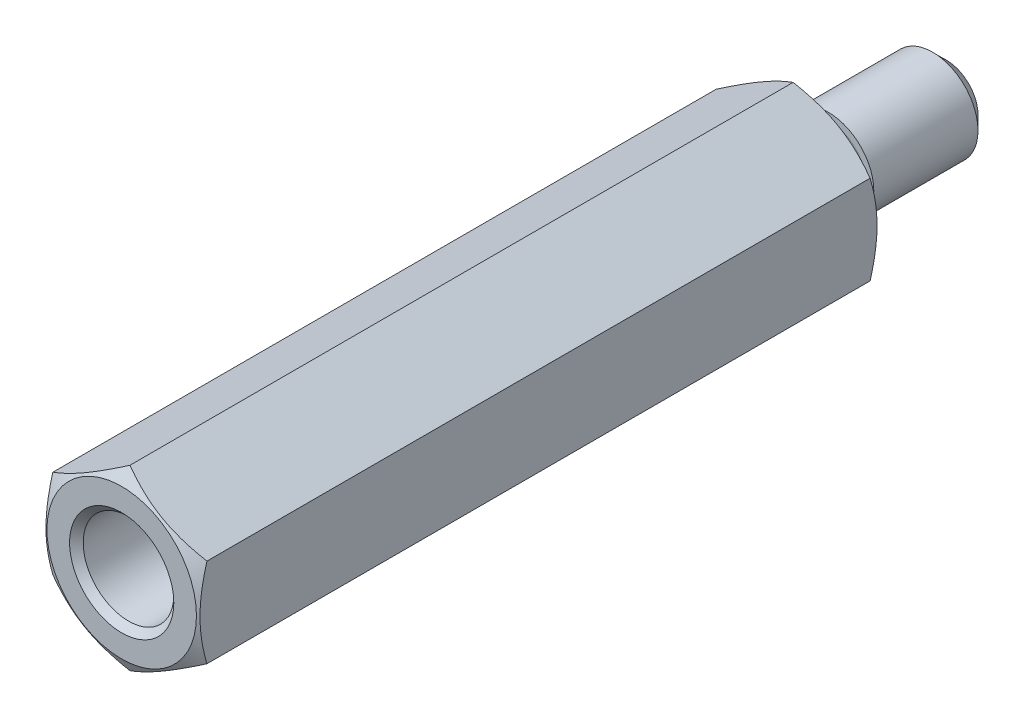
ISO-10303-21;
HEADER;
FILE_DESCRIPTION(('STEP AP214'),'2;1');
FILE_NAME('part.step','',(''),(''),'','','');
FILE_SCHEMA(('AUTOMOTIVE_DESIGN { 1 0 10303 214 1 1 1 1 }'));
ENDSEC;
DATA;
#1=APPLICATION_CONTEXT('core data for automotive mechanical design processes');
#2=APPLICATION_PROTOCOL_DEFINITION('international standard','automotive_design',2000,#1);
#3=PRODUCT_CONTEXT('',#1,'mechanical');
#4=PRODUCT('Part','Part','',(#3));
#5=PRODUCT_RELATED_PRODUCT_CATEGORY('part','',(#4));
#6=PRODUCT_DEFINITION_FORMATION('','',#4);
#7=PRODUCT_DEFINITION_CONTEXT('part definition',#1,'design');
#8=PRODUCT_DEFINITION('design','',#6,#7);
#9=PRODUCT_DEFINITION_SHAPE('','',#8);
#10=(LENGTH_UNIT() NAMED_UNIT(*) SI_UNIT(.MILLI.,.METRE.));
#11=(NAMED_UNIT(*) PLANE_ANGLE_UNIT() SI_UNIT($,.RADIAN.));
#12=(NAMED_UNIT(*) SI_UNIT($,.STERADIAN.) SOLID_ANGLE_UNIT());
#13=UNCERTAINTY_MEASURE_WITH_UNIT(LENGTH_MEASURE(1.E-05),#10,'distance_accuracy_value','');
#14=(GEOMETRIC_REPRESENTATION_CONTEXT(3) GLOBAL_UNCERTAINTY_ASSIGNED_CONTEXT((#13)) GLOBAL_UNIT_ASSIGNED_CONTEXT((#10,
#11,#12)) REPRESENTATION_CONTEXT('',''));
#15=CARTESIAN_POINT('',(0.,0.,0.));
#16=DIRECTION('',(0.,0.,1.));
#17=DIRECTION('',(1.,0.,0.));
#18=AXIS2_PLACEMENT_3D('',#15,#16,#17);
#19=CARTESIAN_POINT('',(8.5,4.90747728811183,0.));
#20=DIRECTION('',(0.,0.,-1.));
#21=DIRECTION('',(-1.,0.,0.));
#22=AXIS2_PLACEMENT_3D('',#19,#20,#21);
#23=PLANE('',#22);
#24=CARTESIAN_POINT('',(0.,0.,0.));
#25=DIRECTION('',(0.,0.,-1.));
#26=DIRECTION('',(-1.,0.,0.));
#27=AXIS2_PLACEMENT_3D('',#24,#25,#26);
#28=CIRCLE('',#27,4.25);
#29=CARTESIAN_POINT('',(-4.25,0.,0.));
#30=VERTEX_POINT('',#29);
#31=EDGE_CURVE('E9',#30,#30,#28,.F.);
#32=ORIENTED_EDGE('',*,*,#31,.T.);
#33=EDGE_LOOP('',(#32));
#34=FACE_BOUND('',#33,.T.);
#35=CARTESIAN_POINT('',(0.,0.,0.));
#36=DIRECTION('',(0.,0.,1.));
#37=DIRECTION('',(1.,0.,0.));
#38=AXIS2_PLACEMENT_3D('',#35,#36,#37);
#39=CIRCLE('',#38,8.25);
#40=CARTESIAN_POINT('',(8.25,0.,0.));
#41=VERTEX_POINT('',#40);
#42=EDGE_CURVE('E136',#41,#41,#39,.T.);
#43=ORIENTED_EDGE('',*,*,#42,.F.);
#44=EDGE_LOOP('',(#43));
#45=FACE_BOUND('',#44,.T.);
#46=ADVANCED_FACE('F14',(#34,#45),#23,.T.);
#47=CARTESIAN_POINT('',(0.,0.,42.756485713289));
#48=DIRECTION('',(0.,0.,1.));
#49=DIRECTION('',(1.,0.,0.));
#50=AXIS2_PLACEMENT_3D('',#47,#48,#49);
#51=CYLINDRICAL_SURFACE('',#50,3.85);
#52=CARTESIAN_POINT('',(0.,0.,-2.6));
#53=DIRECTION('',(0.,0.,-1.));
#54=DIRECTION('',(-1.,0.,0.));
#55=AXIS2_PLACEMENT_3D('',#52,#53,#54);
#56=CIRCLE('',#55,3.85);
#57=CARTESIAN_POINT('',(-3.85,0.,-2.6));
#58=VERTEX_POINT('',#57);
#59=EDGE_CURVE('E103',#58,#58,#56,.F.);
#60=ORIENTED_EDGE('',*,*,#59,.T.);
#61=EDGE_LOOP('',(#60));
#62=FACE_BOUND('',#61,.T.);
#63=CARTESIAN_POINT('',(0.,0.,-0.4));
#64=DIRECTION('',(0.,0.,-1.));
#65=DIRECTION('',(-1.,0.,0.));
#66=AXIS2_PLACEMENT_3D('',#63,#64,#65);
#67=CIRCLE('',#66,3.85);
#68=CARTESIAN_POINT('',(-3.85,0.,-0.4));
#69=VERTEX_POINT('',#68);
#70=EDGE_CURVE('E100',#69,#69,#67,.T.);
#71=ORIENTED_EDGE('',*,*,#70,.T.);
#72=EDGE_LOOP('',(#71));
#73=FACE_BOUND('',#72,.T.);
#74=ADVANCED_FACE('F120',(#62,#73),#51,.T.);
#75=CARTESIAN_POINT('',(0.,3.85,-3.));
#76=DIRECTION('',(0.,0.,-1.));
#77=DIRECTION('',(-1.,0.,0.));
#78=AXIS2_PLACEMENT_3D('',#75,#76,#77);
#79=PLANE('',#78);
#80=CARTESIAN_POINT('',(0.,0.,-3.));
#81=DIRECTION('',(0.,0.,-1.));
#82=DIRECTION('',(-1.,0.,0.));
#83=AXIS2_PLACEMENT_3D('',#80,#81,#82);
#84=CIRCLE('',#83,4.25);
#85=CARTESIAN_POINT('',(-4.25,0.,-3.));
#86=VERTEX_POINT('',#85);
#87=EDGE_CURVE('E24',#86,#86,#84,.T.);
#88=ORIENTED_EDGE('',*,*,#87,.T.);
#89=EDGE_LOOP('',(#88));
#90=FACE_BOUND('',#89,.T.);
#91=CARTESIAN_POINT('',(0.,0.,-3.));
#92=DIRECTION('',(0.,0.,1.));
#93=DIRECTION('',(1.,0.,0.));
#94=AXIS2_PLACEMENT_3D('',#91,#92,#93);
#95=CIRCLE('',#94,5.);
#96=CARTESIAN_POINT('',(5.,0.,-3.));
#97=VERTEX_POINT('',#96);
#98=EDGE_CURVE('E269',#97,#97,#95,.T.);
#99=ORIENTED_EDGE('',*,*,#98,.T.);
#100=EDGE_LOOP('',(#99));
#101=FACE_BOUND('',#100,.T.);
#102=ADVANCED_FACE('F109',(#90,#101),#79,.F.);
#103=CARTESIAN_POINT('',(0.,0.,42.756485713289));
#104=DIRECTION('',(0.,0.,1.));
#105=DIRECTION('',(1.,0.,0.));
#106=AXIS2_PLACEMENT_3D('',#103,#104,#105);
#107=CYLINDRICAL_SURFACE('',#106,5.);
#108=CARTESIAN_POINT('',(0.,0.,-14.5));
#109=DIRECTION('',(0.,0.,1.));
#110=DIRECTION('',(1.,0.,0.));
#111=AXIS2_PLACEMENT_3D('',#108,#109,#110);
#112=CIRCLE('',#111,5.);
#113=CARTESIAN_POINT('',(5.,0.,-14.5));
#114=VERTEX_POINT('',#113);
#115=EDGE_CURVE('E88',#114,#114,#112,.T.);
#116=ORIENTED_EDGE('',*,*,#115,.T.);
#117=EDGE_LOOP('',(#116));
#118=FACE_BOUND('',#117,.T.);
#119=ORIENTED_EDGE('',*,*,#98,.F.);
#120=EDGE_LOOP('',(#119));
#121=FACE_BOUND('',#120,.T.);
#122=ADVANCED_FACE('F392',(#118,#121),#107,.T.);
#123=CARTESIAN_POINT('',(0.,5.,-16.));
#124=DIRECTION('',(0.,0.,1.));
#125=DIRECTION('',(1.,0.,0.));
#126=AXIS2_PLACEMENT_3D('',#123,#124,#125);
#127=PLANE('',#126);
#128=CARTESIAN_POINT('',(0.,0.,-16.));
#129=DIRECTION('',(0.,0.,1.));
#130=DIRECTION('',(1.,0.,0.));
#131=AXIS2_PLACEMENT_3D('',#128,#129,#130);
#132=CIRCLE('',#131,3.5);
#133=CARTESIAN_POINT('',(3.5,0.,-16.));
#134=VERTEX_POINT('',#133);
#135=EDGE_CURVE('E92',#134,#134,#132,.F.);
#136=ORIENTED_EDGE('',*,*,#135,.T.);
#137=EDGE_LOOP('',(#136));
#138=FACE_BOUND('',#137,.T.);
#139=ADVANCED_FACE('F382',(#138),#127,.F.);
#140=CARTESIAN_POINT('',(0.,0.,-14.5));
#141=DIRECTION('',(0.,0.,1.));
#142=DIRECTION('',(1.,0.,0.));
#143=AXIS2_PLACEMENT_3D('',#140,#141,#142);
#144=CONICAL_SURFACE('',#143,5.,0.785398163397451);
#145=ORIENTED_EDGE('',*,*,#135,.F.);
#146=EDGE_LOOP('',(#145));
#147=FACE_BOUND('',#146,.T.);
#148=ORIENTED_EDGE('',*,*,#115,.F.);
#149=EDGE_LOOP('',(#148));
#150=FACE_BOUND('',#149,.T.);
#151=ADVANCED_FACE('F116',(#147,#150),#144,.T.);
#152=CARTESIAN_POINT('',(0.,0.,-2.6));
#153=DIRECTION('',(0.,0.,-1.));
#154=DIRECTION('',(-1.,0.,0.));
#155=AXIS2_PLACEMENT_3D('',#152,#153,#154);
#156=TOROIDAL_SURFACE('',#155,4.25,0.4);
#157=ORIENTED_EDGE('',*,*,#87,.F.);
#158=EDGE_LOOP('',(#157));
#159=FACE_BOUND('',#158,.T.);
#160=ORIENTED_EDGE('',*,*,#59,.F.);
#161=EDGE_LOOP('',(#160));
#162=FACE_BOUND('',#161,.T.);
#163=ADVANCED_FACE('F112',(#159,#162),#156,.F.);
#164=CARTESIAN_POINT('',(0.,0.,-0.4));
#165=DIRECTION('',(0.,0.,-1.));
#166=DIRECTION('',(-1.,0.,0.));
#167=AXIS2_PLACEMENT_3D('',#164,#165,#166);
#168=TOROIDAL_SURFACE('',#167,4.25,0.4);
#169=ORIENTED_EDGE('',*,*,#70,.F.);
#170=EDGE_LOOP('',(#169));
#171=FACE_BOUND('',#170,.T.);
#172=ORIENTED_EDGE('',*,*,#31,.F.);
#173=EDGE_LOOP('',(#172));
#174=FACE_BOUND('',#173,.T.);
#175=ADVANCED_FACE('F115',(#171,#174),#168,.F.);
#176=CARTESIAN_POINT('',(0.,0.,0.903526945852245));
#177=DIRECTION('',(0.,0.,1.));
#178=DIRECTION('',(1.,0.,0.));
#179=AXIS2_PLACEMENT_3D('',#176,#177,#178);
#180=CONICAL_SURFACE('',#179,9.81495457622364,1.0471975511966);
#181=ORIENTED_EDGE('',*,*,#42,.T.);
#182=EDGE_LOOP('',(#181));
#183=FACE_BOUND('',#182,.T.);
#184=CARTESIAN_POINT('',(-0.000199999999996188,9.81507004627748,0.903593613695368));
#185=CARTESIAN_POINT('',(0.186639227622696,9.70719836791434,0.841323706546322));
#186=CARTESIAN_POINT('',(0.374175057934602,9.59892450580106,0.781879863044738));
#187=CARTESIAN_POINT('',(0.750769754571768,9.38149745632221,0.669422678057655));
#188=CARTESIAN_POINT('',(0.939829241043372,9.27234391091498,0.616412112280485));
#189=CARTESIAN_POINT('',(1.5100347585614,8.94313560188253,0.468070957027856));
#190=CARTESIAN_POINT('',(1.89343164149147,8.72178130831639,0.383696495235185));
#191=CARTESIAN_POINT('',(2.46717766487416,8.39052888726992,0.284757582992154));
#192=CARTESIAN_POINT('',(2.65581276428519,8.28162036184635,0.256572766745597));
#193=CARTESIAN_POINT('',(3.03393602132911,8.06331079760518,0.209311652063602));
#194=CARTESIAN_POINT('',(3.22342410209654,7.95390980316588,0.190234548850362));
#195=CARTESIAN_POINT('',(3.6027265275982,7.73491944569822,0.161672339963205));
#196=CARTESIAN_POINT('',(3.7925402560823,7.62533043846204,0.152176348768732));
#197=CARTESIAN_POINT('',(4.17234305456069,7.40605119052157,0.142979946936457));
#198=CARTESIAN_POINT('',(4.36233211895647,7.29636095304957,0.143279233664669));
#199=CARTESIAN_POINT('',(4.71752301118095,7.09129139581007,0.152992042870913));
#200=CARTESIAN_POINT('',(4.8827499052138,6.99589760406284,0.161220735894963));
#201=CARTESIAN_POINT('',(5.21281671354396,6.80533344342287,0.184926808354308));
#202=CARTESIAN_POINT('',(5.37765660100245,6.71016309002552,0.200404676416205));
#203=CARTESIAN_POINT('',(5.87153810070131,6.4250204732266,0.257346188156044));
#204=CARTESIAN_POINT('',(6.19970550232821,6.23555293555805,0.309310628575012));
#205=CARTESIAN_POINT('',(6.85952142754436,5.85460803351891,0.439222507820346));
#206=CARTESIAN_POINT('',(7.19108574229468,5.66317928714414,0.51772063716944));
#207=CARTESIAN_POINT('',(7.84926989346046,5.28317649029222,0.695878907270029));
#208=CARTESIAN_POINT('',(8.17589815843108,5.0945975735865,0.795497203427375));
#209=CARTESIAN_POINT('',(8.5002,4.90736181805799,0.903593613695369));
#210=B_SPLINE_CURVE_WITH_KNOTS('',3,(#184,#185,#186,#187,#188,#189,#190,#191,#192,#193,#194,
#195,#196,#197,#198,#199,#200,#201,#202,#203,#204,#205,#206,#207,#208,#209),.UNSPECIFIED.,.F.,
.F.,(4,2,2,2,2,2,2,2,2,2,2,2,4),(0.,0.673596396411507,1.34748239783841,2.69805431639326,
3.356799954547,4.01548737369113,4.67342558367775,5.33134346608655,5.90409556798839,
6.47688628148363,7.62328361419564,8.79510569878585,9.96462743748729),.UNSPECIFIED.);
#211=CARTESIAN_POINT('',(0.,9.81495457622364,0.903526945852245));
#212=VERTEX_POINT('',#211);
#213=CARTESIAN_POINT('',(8.5,4.90747728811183,0.903526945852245));
#214=VERTEX_POINT('',#213);
#215=EDGE_CURVE('E31',#212,#214,#210,.T.);
#216=ORIENTED_EDGE('',*,*,#215,.T.);
#217=CARTESIAN_POINT('',(8.5,-12.9953438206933,4.20214445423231));
#218=CARTESIAN_POINT('',(8.5,-12.6223011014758,4.02195280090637));
#219=CARTESIAN_POINT('',(8.5,-12.2483741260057,3.84355854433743));
#220=CARTESIAN_POINT('',(8.5,-11.4982734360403,3.49139239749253));
#221=CARTESIAN_POINT('',(8.5,-11.1220993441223,3.31762131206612));
#222=CARTESIAN_POINT('',(8.5,-10.3649842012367,2.97480925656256));
#223=CARTESIAN_POINT('',(8.5,-9.98402817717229,2.80580123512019));
#224=CARTESIAN_POINT('',(8.5,-9.21897765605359,2.47507337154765));
#225=CARTESIAN_POINT('',(8.5,-8.83488332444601,2.31335314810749));
#226=CARTESIAN_POINT('',(8.5,-8.05827000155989,1.99725792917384));
#227=CARTESIAN_POINT('',(8.5,-7.66570525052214,1.84299473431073));
#228=CARTESIAN_POINT('',(8.5,-6.87593938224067,1.54660014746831));
#229=CARTESIAN_POINT('',(8.5,-6.47873775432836,1.40447010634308));
#230=CARTESIAN_POINT('',(8.5,-5.67988381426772,1.13617601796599));
#231=CARTESIAN_POINT('',(8.5,-5.27824308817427,1.00997785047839));
#232=CARTESIAN_POINT('',(8.5,-4.46926711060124,0.777656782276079));
#233=CARTESIAN_POINT('',(8.5,-4.06193370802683,0.671527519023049));
#234=CARTESIAN_POINT('',(8.5,-3.24121808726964,0.484515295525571));
#235=CARTESIAN_POINT('',(8.5,-2.82783404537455,0.403640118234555));
#236=CARTESIAN_POINT('',(8.5,-2.20413783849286,0.305328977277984));
#237=CARTESIAN_POINT('',(8.5,-1.99561028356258,0.276390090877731));
#238=CARTESIAN_POINT('',(8.5,-1.57758365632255,0.226749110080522));
#239=CARTESIAN_POINT('',(8.5,-1.36808467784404,0.206046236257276));
#240=CARTESIAN_POINT('',(8.5,-0.94971684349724,0.173433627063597));
#241=CARTESIAN_POINT('',(8.5,-0.740852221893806,0.161469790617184));
#242=CARTESIAN_POINT('',(8.5,-0.322804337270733,0.146398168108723));
#243=CARTESIAN_POINT('',(8.5,-0.11362107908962,0.143290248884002));
#244=CARTESIAN_POINT('',(8.5,0.3046299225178,0.14600440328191));
#245=CARTESIAN_POINT('',(8.5,0.513697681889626,0.151823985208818));
#246=CARTESIAN_POINT('',(8.5,0.93140649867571,0.172248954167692));
#247=CARTESIAN_POINT('',(8.5,1.14004753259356,0.186854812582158));
#248=CARTESIAN_POINT('',(8.5,1.64621912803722,0.232643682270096));
#249=CARTESIAN_POINT('',(8.5,1.94335676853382,0.268255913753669));
#250=CARTESIAN_POINT('',(8.5,2.53529083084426,0.355313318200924));
#251=CARTESIAN_POINT('',(8.5,2.83008689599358,0.406760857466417));
#252=CARTESIAN_POINT('',(8.5,3.71148367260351,0.582274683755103));
#253=CARTESIAN_POINT('',(8.5,4.29393978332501,0.727394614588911));
#254=CARTESIAN_POINT('',(8.5,5.16515755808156,0.977457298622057));
#255=CARTESIAN_POINT('',(8.5,5.45847541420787,1.06742556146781));
#256=CARTESIAN_POINT('',(8.5,6.04227759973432,1.25629246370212));
#257=CARTESIAN_POINT('',(8.5,6.33276167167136,1.35519190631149));
#258=CARTESIAN_POINT('',(8.5,6.90944623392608,1.55980497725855));
#259=CARTESIAN_POINT('',(8.5,7.19566165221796,1.66547695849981));
#260=CARTESIAN_POINT('',(8.5,7.76565926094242,1.88291533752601));
#261=CARTESIAN_POINT('',(8.5,8.04944225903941,1.99467961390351));
#262=CARTESIAN_POINT('',(8.5,8.33220149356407,2.10891920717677));
#263=B_SPLINE_CURVE_WITH_KNOTS('',3,(#217,#218,#219,#220,#221,#222,#223,#224,#225,#226,#227,
#228,#229,#230,#231,#232,#233,#234,#235,#236,#237,#238,#239,#240,#241,#242,#243,#244,#245,#246,
#247,#248,#249,#250,#251,#252,#253,#254,#255,#256,#257,#258,#259,#260,#261,#262),.UNSPECIFIED.,
.F.,.F.,(4,2,2,2,2,2,2,2,2,2,2,2,2,2,2,2,2,2,2,2,2,2,4),(0.,1.24286396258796,2.48594289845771,
3.73617049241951,4.98633259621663,6.25153784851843,7.51688378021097,8.77947209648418,
10.0416594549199,11.3042354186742,11.93567629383,12.5670573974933,13.1944958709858,
13.8219249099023,14.4491788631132,15.0764664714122,15.9737486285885,16.8711649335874,
18.6694595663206,19.5898052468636,20.5102337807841,21.4254630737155,22.3403756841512),.UNSPECIFIED.);
#264=CARTESIAN_POINT('',(8.5,-4.90747728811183,0.903526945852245));
#265=VERTEX_POINT('',#264);
#266=EDGE_CURVE('E138',#214,#265,#263,.F.);
#267=ORIENTED_EDGE('',*,*,#266,.T.);
#268=CARTESIAN_POINT('',(8.5002,-4.90736181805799,0.903593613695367));
#269=CARTESIAN_POINT('',(8.31336077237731,-5.01523349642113,0.841323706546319));
#270=CARTESIAN_POINT('',(8.1258249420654,-5.12350735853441,0.781879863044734));
#271=CARTESIAN_POINT('',(7.74923024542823,-5.34093440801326,0.66942267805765));
#272=CARTESIAN_POINT('',(7.56017075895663,-5.45008795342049,0.61641211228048));
#273=CARTESIAN_POINT('',(6.9899652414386,-5.77929626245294,0.468070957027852));
#274=CARTESIAN_POINT('',(6.60656835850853,-6.00065055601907,0.383696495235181));
#275=CARTESIAN_POINT('',(6.03282233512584,-6.33190297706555,0.28475758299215));
#276=CARTESIAN_POINT('',(5.84418723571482,-6.44081150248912,0.256572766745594));
#277=CARTESIAN_POINT('',(5.46606397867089,-6.65912106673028,0.209311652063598));
#278=CARTESIAN_POINT('',(5.27657589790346,-6.76852206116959,0.190234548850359));
#279=CARTESIAN_POINT('',(4.8972734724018,-6.98751241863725,0.161672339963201));
#280=CARTESIAN_POINT('',(4.70745974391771,-7.09710142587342,0.152176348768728));
#281=CARTESIAN_POINT('',(4.32765694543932,-7.3163806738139,0.142979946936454));
#282=CARTESIAN_POINT('',(4.13766788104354,-7.42607091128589,0.143279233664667));
#283=CARTESIAN_POINT('',(3.78247698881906,-7.63114046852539,0.152992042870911));
#284=CARTESIAN_POINT('',(3.6172500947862,-7.72653426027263,0.161220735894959));
#285=CARTESIAN_POINT('',(3.28718328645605,-7.9170984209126,0.184926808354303));
#286=CARTESIAN_POINT('',(3.12234339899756,-8.01226877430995,0.2004046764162));
#287=CARTESIAN_POINT('',(2.62846189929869,-8.29741139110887,0.25734618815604));
#288=CARTESIAN_POINT('',(2.30029449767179,-8.48687892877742,0.309310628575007));
#289=CARTESIAN_POINT('',(1.64047857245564,-8.86782383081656,0.439222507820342));
#290=CARTESIAN_POINT('',(1.30891425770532,-9.05925257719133,0.517720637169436));
#291=CARTESIAN_POINT('',(0.650730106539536,-9.43925537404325,0.695878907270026));
#292=CARTESIAN_POINT('',(0.324101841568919,-9.62783429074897,0.795497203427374));
#293=CARTESIAN_POINT('',(-0.000200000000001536,-9.81507004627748,0.903593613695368));
#294=B_SPLINE_CURVE_WITH_KNOTS('',3,(#268,#269,#270,#271,#272,#273,#274,#275,#276,#277,#278,
#279,#280,#281,#282,#283,#284,#285,#286,#287,#288,#289,#290,#291,#292,#293),.UNSPECIFIED.,.F.,
.F.,(4,2,2,2,2,2,2,2,2,2,2,2,4),(0.,0.673596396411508,1.34748239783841,2.69805431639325,
3.35679995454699,4.01548737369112,4.67342558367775,5.33134346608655,5.90409556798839,
6.47688628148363,7.62328361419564,8.79510569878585,9.9646274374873),.UNSPECIFIED.);
#295=CARTESIAN_POINT('',(0.,-9.81495457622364,0.903526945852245));
#296=VERTEX_POINT('',#295);
#297=EDGE_CURVE('E140',#265,#296,#294,.T.);
#298=ORIENTED_EDGE('',*,*,#297,.T.);
#299=CARTESIAN_POINT('',(0.000199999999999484,-9.81507004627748,0.903593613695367));
#300=CARTESIAN_POINT('',(-0.186639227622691,-9.70719836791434,0.84132370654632));
#301=CARTESIAN_POINT('',(-0.374175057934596,-9.59892450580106,0.781879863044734));
#302=CARTESIAN_POINT('',(-0.750769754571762,-9.3814974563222,0.66942267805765));
#303=CARTESIAN_POINT('',(-0.939829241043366,-9.27234391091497,0.616412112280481));
#304=CARTESIAN_POINT('',(-1.5100347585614,-8.94313560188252,0.468070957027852));
#305=CARTESIAN_POINT('',(-1.89343164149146,-8.72178130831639,0.383696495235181));
#306=CARTESIAN_POINT('',(-2.46717766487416,-8.39052888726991,0.284757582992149));
#307=CARTESIAN_POINT('',(-2.65581276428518,-8.28162036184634,0.256572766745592));
#308=CARTESIAN_POINT('',(-3.03393602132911,-8.06331079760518,0.209311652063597));
#309=CARTESIAN_POINT('',(-3.22342410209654,-7.95390980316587,0.190234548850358));
#310=CARTESIAN_POINT('',(-3.6027265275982,-7.73491944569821,0.1616723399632));
#311=CARTESIAN_POINT('',(-3.79254025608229,-7.62533043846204,0.152176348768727));
#312=CARTESIAN_POINT('',(-4.17234305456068,-7.40605119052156,0.142979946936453));
#313=CARTESIAN_POINT('',(-4.36233211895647,-7.29636095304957,0.143279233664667));
#314=CARTESIAN_POINT('',(-4.71752301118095,-7.09129139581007,0.152992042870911));
#315=CARTESIAN_POINT('',(-4.8827499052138,-6.99589760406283,0.161220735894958));
#316=CARTESIAN_POINT('',(-5.21281671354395,-6.80533344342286,0.184926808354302));
#317=CARTESIAN_POINT('',(-5.37765660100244,-6.71016309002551,0.2004046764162));
#318=CARTESIAN_POINT('',(-5.87153810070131,-6.42502047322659,0.257346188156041));
#319=CARTESIAN_POINT('',(-6.19970550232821,-6.23555293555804,0.309310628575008));
#320=CARTESIAN_POINT('',(-6.85952142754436,-5.8546080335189,0.439222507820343));
#321=CARTESIAN_POINT('',(-7.19108574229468,-5.66317928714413,0.517720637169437));
#322=CARTESIAN_POINT('',(-7.84926989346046,-5.28317649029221,0.695878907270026));
#323=CARTESIAN_POINT('',(-8.17589815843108,-5.09459757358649,0.795497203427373));
#324=CARTESIAN_POINT('',(-8.5002,-4.90736181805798,0.903593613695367));
#325=B_SPLINE_CURVE_WITH_KNOTS('',3,(#299,#300,#301,#302,#303,#304,#305,#306,#307,#308,#309,
#310,#311,#312,#313,#314,#315,#316,#317,#318,#319,#320,#321,#322,#323,#324),.UNSPECIFIED.,.F.,
.F.,(4,2,2,2,2,2,2,2,2,2,2,2,4),(0.,0.673596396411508,1.34748239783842,2.69805431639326,
3.356799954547,4.01548737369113,4.67342558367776,5.33134346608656,5.9040955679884,
6.47688628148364,7.62328361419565,8.79510569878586,9.9646274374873),.UNSPECIFIED.);
#326=CARTESIAN_POINT('',(-8.5,-4.90747728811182,0.903526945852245));
#327=VERTEX_POINT('',#326);
#328=EDGE_CURVE('E237',#296,#327,#325,.T.);
#329=ORIENTED_EDGE('',*,*,#328,.T.);
#330=CARTESIAN_POINT('',(-8.5,-12.9953438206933,4.20214445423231));
#331=CARTESIAN_POINT('',(-8.5,-12.6223011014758,4.02195280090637));
#332=CARTESIAN_POINT('',(-8.5,-12.2483741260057,3.84355854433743));
#333=CARTESIAN_POINT('',(-8.5,-11.4982734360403,3.49139239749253));
#334=CARTESIAN_POINT('',(-8.5,-11.1220993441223,3.31762131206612));
#335=CARTESIAN_POINT('',(-8.5,-10.3649842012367,2.97480925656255));
#336=CARTESIAN_POINT('',(-8.5,-9.98402817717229,2.80580123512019));
#337=CARTESIAN_POINT('',(-8.5,-9.21897765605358,2.47507337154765));
#338=CARTESIAN_POINT('',(-8.5,-8.834883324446,2.31335314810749));
#339=CARTESIAN_POINT('',(-8.5,-8.05827000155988,1.99725792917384));
#340=CARTESIAN_POINT('',(-8.5,-7.66570525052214,1.84299473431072));
#341=CARTESIAN_POINT('',(-8.5,-6.87593938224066,1.54660014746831));
#342=CARTESIAN_POINT('',(-8.5,-6.47873775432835,1.40447010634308));
#343=CARTESIAN_POINT('',(-8.5,-5.67988381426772,1.13617601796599));
#344=CARTESIAN_POINT('',(-8.5,-5.27824308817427,1.00997785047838));
#345=CARTESIAN_POINT('',(-8.5,-4.46926711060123,0.777656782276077));
#346=CARTESIAN_POINT('',(-8.5,-4.06193370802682,0.671527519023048));
#347=CARTESIAN_POINT('',(-8.5,-3.24121808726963,0.48451529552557));
#348=CARTESIAN_POINT('',(-8.5,-2.82783404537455,0.403640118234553));
#349=CARTESIAN_POINT('',(-8.5,-2.20413783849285,0.305328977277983));
#350=CARTESIAN_POINT('',(-8.5,-1.99561028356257,0.27639009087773));
#351=CARTESIAN_POINT('',(-8.5,-1.57758365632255,0.226749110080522));
#352=CARTESIAN_POINT('',(-8.5,-1.36808467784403,0.206046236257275));
#353=CARTESIAN_POINT('',(-8.5,-0.949716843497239,0.173433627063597));
#354=CARTESIAN_POINT('',(-8.5,-0.740852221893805,0.161469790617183));
#355=CARTESIAN_POINT('',(-8.5,-0.322804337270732,0.146398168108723));
#356=CARTESIAN_POINT('',(-8.5,-0.113621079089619,0.143290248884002));
#357=CARTESIAN_POINT('',(-8.5,0.304629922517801,0.146004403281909));
#358=CARTESIAN_POINT('',(-8.5,0.513697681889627,0.151823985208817));
#359=CARTESIAN_POINT('',(-8.5,0.931406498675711,0.172248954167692));
#360=CARTESIAN_POINT('',(-8.5,1.14004753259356,0.186854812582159));
#361=CARTESIAN_POINT('',(-8.5,1.64621912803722,0.232643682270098));
#362=CARTESIAN_POINT('',(-8.5,1.94335676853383,0.268255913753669));
#363=CARTESIAN_POINT('',(-8.5,2.53529083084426,0.355313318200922));
#364=CARTESIAN_POINT('',(-8.5,2.83008689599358,0.406760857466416));
#365=CARTESIAN_POINT('',(-8.5,3.71148367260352,0.582274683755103));
#366=CARTESIAN_POINT('',(-8.5,4.29393978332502,0.727394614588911));
#367=CARTESIAN_POINT('',(-8.5,5.16515755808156,0.977457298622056));
#368=CARTESIAN_POINT('',(-8.5,5.45847541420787,1.06742556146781));
#369=CARTESIAN_POINT('',(-8.5,6.04227759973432,1.25629246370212));
#370=CARTESIAN_POINT('',(-8.5,6.33276167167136,1.35519190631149));
#371=CARTESIAN_POINT('',(-8.5,6.90944623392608,1.55980497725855));
#372=CARTESIAN_POINT('',(-8.5,7.19566165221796,1.66547695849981));
#373=CARTESIAN_POINT('',(-8.5,7.76565926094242,1.88291533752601));
#374=CARTESIAN_POINT('',(-8.5,8.04944225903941,1.99467961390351));
#375=CARTESIAN_POINT('',(-8.5,8.33220149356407,2.10891920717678));
#376=B_SPLINE_CURVE_WITH_KNOTS('',3,(#330,#331,#332,#333,#334,#335,#336,#337,#338,#339,#340,
#341,#342,#343,#344,#345,#346,#347,#348,#349,#350,#351,#352,#353,#354,#355,#356,#357,#358,#359,
#360,#361,#362,#363,#364,#365,#366,#367,#368,#369,#370,#371,#372,#373,#374,#375),.UNSPECIFIED.,
.F.,.F.,(4,2,2,2,2,2,2,2,2,2,2,2,2,2,2,2,2,2,2,2,2,2,4),(0.,1.24286396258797,2.48594289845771,
3.73617049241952,4.98633259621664,6.25153784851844,7.51688378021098,8.77947209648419,
10.0416594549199,11.3042354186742,11.93567629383,12.5670573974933,13.1944958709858,
13.8219249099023,14.4491788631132,15.0764664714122,15.9737486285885,16.8711649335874,
18.6694595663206,19.5898052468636,20.5102337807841,21.4254630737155,22.3403756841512),.UNSPECIFIED.);
#377=CARTESIAN_POINT('',(-8.5,4.90747728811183,0.903526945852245));
#378=VERTEX_POINT('',#377);
#379=EDGE_CURVE('E70',#327,#378,#376,.T.);
#380=ORIENTED_EDGE('',*,*,#379,.T.);
#381=CARTESIAN_POINT('',(-8.5002,4.90736181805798,0.903593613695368));
#382=CARTESIAN_POINT('',(-8.31336077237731,5.01523349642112,0.84132370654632));
#383=CARTESIAN_POINT('',(-8.1258249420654,5.1235073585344,0.781879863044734));
#384=CARTESIAN_POINT('',(-7.74923024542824,5.34093440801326,0.66942267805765));
#385=CARTESIAN_POINT('',(-7.56017075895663,5.45008795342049,0.616412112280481));
#386=CARTESIAN_POINT('',(-6.9899652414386,5.77929626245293,0.468070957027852));
#387=CARTESIAN_POINT('',(-6.60656835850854,6.00065055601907,0.38369649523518));
#388=CARTESIAN_POINT('',(-6.03282233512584,6.33190297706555,0.28475758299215));
#389=CARTESIAN_POINT('',(-5.84418723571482,6.44081150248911,0.256572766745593));
#390=CARTESIAN_POINT('',(-5.46606397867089,6.65912106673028,0.209311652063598));
#391=CARTESIAN_POINT('',(-5.27657589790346,6.76852206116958,0.190234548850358));
#392=CARTESIAN_POINT('',(-4.8972734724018,6.98751241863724,0.161672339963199));
#393=CARTESIAN_POINT('',(-4.70745974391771,7.09710142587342,0.152176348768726));
#394=CARTESIAN_POINT('',(-4.32765694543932,7.3163806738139,0.142979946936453));
#395=CARTESIAN_POINT('',(-4.13766788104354,7.42607091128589,0.143279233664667));
#396=CARTESIAN_POINT('',(-3.78247698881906,7.63114046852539,0.152992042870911));
#397=CARTESIAN_POINT('',(-3.6172500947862,7.72653426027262,0.161220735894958));
#398=CARTESIAN_POINT('',(-3.28718328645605,7.9170984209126,0.184926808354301));
#399=CARTESIAN_POINT('',(-3.12234339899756,8.01226877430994,0.200404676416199));
#400=CARTESIAN_POINT('',(-2.62846189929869,8.29741139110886,0.25734618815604));
#401=CARTESIAN_POINT('',(-2.30029449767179,8.48687892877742,0.309310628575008));
#402=CARTESIAN_POINT('',(-1.64047857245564,8.86782383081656,0.439222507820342));
#403=CARTESIAN_POINT('',(-1.30891425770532,9.05925257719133,0.517720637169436));
#404=CARTESIAN_POINT('',(-0.650730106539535,9.43925537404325,0.695878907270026));
#405=CARTESIAN_POINT('',(-0.324101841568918,9.62783429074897,0.795497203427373));
#406=CARTESIAN_POINT('',(0.000200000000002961,9.81507004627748,0.903593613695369));
#407=B_SPLINE_CURVE_WITH_KNOTS('',3,(#381,#382,#383,#384,#385,#386,#387,#388,#389,#390,#391,
#392,#393,#394,#395,#396,#397,#398,#399,#400,#401,#402,#403,#404,#405,#406),.UNSPECIFIED.,.F.,
.F.,(4,2,2,2,2,2,2,2,2,2,2,2,4),(0.,0.673596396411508,1.34748239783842,2.69805431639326,
3.356799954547,4.01548737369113,4.67342558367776,5.33134346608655,5.90409556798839,
6.47688628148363,7.62328361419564,8.79510569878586,9.96462743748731),.UNSPECIFIED.);
#408=EDGE_CURVE('E67',#378,#212,#407,.T.);
#409=ORIENTED_EDGE('',*,*,#408,.T.);
#410=EDGE_LOOP('',(#216,#267,#298,#329,#380,#409));
#411=FACE_BOUND('',#410,.T.);
#412=ADVANCED_FACE('F68',(#183,#411),#180,.T.);
#413=CARTESIAN_POINT('',(0.,0.,75.));
#414=DIRECTION('',(0.,0.,1.));
#415=DIRECTION('',(1.,0.,0.));
#416=AXIS2_PLACEMENT_3D('',#413,#414,#415);
#417=CONICAL_SURFACE('',#416,5.75,0.785398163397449);
#418=CARTESIAN_POINT('',(0.,0.,74.25));
#419=DIRECTION('',(0.,0.,1.));
#420=DIRECTION('',(1.,0.,0.));
#421=AXIS2_PLACEMENT_3D('',#418,#419,#420);
#422=CIRCLE('',#421,5.);
#423=CARTESIAN_POINT('',(5.,0.,74.25));
#424=VERTEX_POINT('',#423);
#425=EDGE_CURVE('E19',#424,#424,#422,.F.);
#426=ORIENTED_EDGE('',*,*,#425,.T.);
#427=EDGE_LOOP('',(#426));
#428=FACE_BOUND('',#427,.T.);
#429=CARTESIAN_POINT('',(0.,0.,75.));
#430=DIRECTION('',(0.,0.,1.));
#431=DIRECTION('',(1.,0.,0.));
#432=AXIS2_PLACEMENT_3D('',#429,#430,#431);
#433=CIRCLE('',#432,5.75);
#434=CARTESIAN_POINT('',(5.75,0.,75.));
#435=VERTEX_POINT('',#434);
#436=EDGE_CURVE('E271',#435,#435,#433,.T.);
#437=ORIENTED_EDGE('',*,*,#436,.T.);
#438=EDGE_LOOP('',(#437));
#439=FACE_BOUND('',#438,.T.);
#440=ADVANCED_FACE('F189',(#428,#439),#417,.F.);
#441=CARTESIAN_POINT('',(8.5,4.90747728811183,75.));
#442=DIRECTION('',(0.,0.,-1.));
#443=DIRECTION('',(-1.,0.,0.));
#444=AXIS2_PLACEMENT_3D('',#441,#442,#443);
#445=PLANE('',#444);
#446=ORIENTED_EDGE('',*,*,#436,.F.);
#447=EDGE_LOOP('',(#446));
#448=FACE_BOUND('',#447,.T.);
#449=CARTESIAN_POINT('',(0.,0.,75.));
#450=DIRECTION('',(0.,0.,1.));
#451=DIRECTION('',(1.,0.,0.));
#452=AXIS2_PLACEMENT_3D('',#449,#450,#451);
#453=CIRCLE('',#452,8.25);
#454=CARTESIAN_POINT('',(8.25,0.,75.));
#455=VERTEX_POINT('',#454);
#456=EDGE_CURVE('E83',#455,#455,#453,.T.);
#457=ORIENTED_EDGE('',*,*,#456,.T.);
#458=EDGE_LOOP('',(#457));
#459=FACE_BOUND('',#458,.T.);
#460=ADVANCED_FACE('F168',(#448,#459),#445,.F.);
#461=CARTESIAN_POINT('',(0.,0.,75.));
#462=DIRECTION('',(0.,0.,-1.));
#463=DIRECTION('',(-1.,0.,0.));
#464=AXIS2_PLACEMENT_3D('',#461,#462,#463);
#465=CONICAL_SURFACE('',#464,8.25,1.0471975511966);
#466=ORIENTED_EDGE('',*,*,#456,.F.);
#467=EDGE_LOOP('',(#466));
#468=FACE_BOUND('',#467,.T.);
#469=CARTESIAN_POINT('',(8.5002,4.90736181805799,74.0964063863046));
#470=CARTESIAN_POINT('',(8.31336077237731,5.01523349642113,74.1586762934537));
#471=CARTESIAN_POINT('',(8.1258249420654,5.12350735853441,74.2181201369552));
#472=CARTESIAN_POINT('',(7.74923024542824,5.34093440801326,74.3305773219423));
#473=CARTESIAN_POINT('',(7.56017075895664,5.4500879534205,74.3835878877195));
#474=CARTESIAN_POINT('',(6.9899652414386,5.77929626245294,74.5319290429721));
#475=CARTESIAN_POINT('',(6.60656835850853,6.00065055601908,74.6163035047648));
#476=CARTESIAN_POINT('',(6.03282233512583,6.33190297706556,74.7152424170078));
#477=CARTESIAN_POINT('',(5.84418723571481,6.44081150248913,74.7434272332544));
#478=CARTESIAN_POINT('',(5.46606397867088,6.6591210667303,74.7906883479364));
#479=CARTESIAN_POINT('',(5.27657589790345,6.7685220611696,74.8097654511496));
#480=CARTESIAN_POINT('',(4.89727347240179,6.98751241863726,74.8383276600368));
#481=CARTESIAN_POINT('',(4.7074597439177,7.09710142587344,74.8478236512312));
#482=CARTESIAN_POINT('',(4.32765694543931,7.31638067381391,74.8570200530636));
#483=CARTESIAN_POINT('',(4.13766788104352,7.4260709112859,74.8567207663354));
#484=CARTESIAN_POINT('',(3.78247698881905,7.6311404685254,74.8470079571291));
#485=CARTESIAN_POINT('',(3.6172500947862,7.72653426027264,74.838779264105));
#486=CARTESIAN_POINT('',(3.28718328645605,7.91709842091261,74.8150731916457));
#487=CARTESIAN_POINT('',(3.12234339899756,8.01226877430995,74.7995953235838));
#488=CARTESIAN_POINT('',(2.62846189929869,8.29741139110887,74.742653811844));
#489=CARTESIAN_POINT('',(2.30029449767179,8.48687892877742,74.690689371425));
#490=CARTESIAN_POINT('',(1.64047857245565,8.86782383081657,74.5607774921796));
#491=CARTESIAN_POINT('',(1.30891425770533,9.05925257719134,74.4822793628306));
#492=CARTESIAN_POINT('',(0.650730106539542,9.43925537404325,74.30412109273));
#493=CARTESIAN_POINT('',(0.324101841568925,9.62783429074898,74.2045027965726));
#494=CARTESIAN_POINT('',(-0.000199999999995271,9.81507004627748,74.0964063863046));
#495=B_SPLINE_CURVE_WITH_KNOTS('',3,(#469,#470,#471,#472,#473,#474,#475,#476,#477,#478,#479,
#480,#481,#482,#483,#484,#485,#486,#487,#488,#489,#490,#491,#492,#493,#494),.UNSPECIFIED.,.F.,
.F.,(4,2,2,2,2,2,2,2,2,2,2,2,4),(0.,0.673596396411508,1.34748239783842,2.69805431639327,
3.35679995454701,4.01548737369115,4.67342558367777,5.33134346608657,5.9040955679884,
6.47688628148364,7.62328361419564,8.79510569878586,9.9646274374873),.UNSPECIFIED.);
#496=CARTESIAN_POINT('',(8.5,4.90747728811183,74.0964730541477));
#497=VERTEX_POINT('',#496);
#498=CARTESIAN_POINT('',(0.,9.81495457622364,74.0964730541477));
#499=VERTEX_POINT('',#498);
#500=EDGE_CURVE('E213',#497,#499,#495,.T.);
#501=ORIENTED_EDGE('',*,*,#500,.T.);
#502=CARTESIAN_POINT('',(0.000200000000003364,9.81507004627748,74.0964063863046));
#503=CARTESIAN_POINT('',(-0.186639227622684,9.70719836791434,74.1586762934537));
#504=CARTESIAN_POINT('',(-0.374175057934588,9.59892450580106,74.2181201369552));
#505=CARTESIAN_POINT('',(-0.750769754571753,9.38149745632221,74.3305773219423));
#506=CARTESIAN_POINT('',(-0.939829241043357,9.27234391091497,74.3835878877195));
#507=CARTESIAN_POINT('',(-1.51003475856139,8.94313560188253,74.5319290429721));
#508=CARTESIAN_POINT('',(-1.89343164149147,8.72178130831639,74.6163035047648));
#509=CARTESIAN_POINT('',(-2.46717766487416,8.39052888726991,74.7152424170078));
#510=CARTESIAN_POINT('',(-2.65581276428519,8.28162036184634,74.7434272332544));
#511=CARTESIAN_POINT('',(-3.03393602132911,8.06331079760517,74.7906883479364));
#512=CARTESIAN_POINT('',(-3.22342410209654,7.95390980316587,74.8097654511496));
#513=CARTESIAN_POINT('',(-3.6027265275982,7.73491944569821,74.8383276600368));
#514=CARTESIAN_POINT('',(-3.79254025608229,7.62533043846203,74.8478236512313));
#515=CARTESIAN_POINT('',(-4.17234305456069,7.40605119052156,74.8570200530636));
#516=CARTESIAN_POINT('',(-4.36233211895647,7.29636095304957,74.8567207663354));
#517=CARTESIAN_POINT('',(-4.71752301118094,7.09129139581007,74.8470079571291));
#518=CARTESIAN_POINT('',(-4.8827499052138,6.99589760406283,74.838779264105));
#519=CARTESIAN_POINT('',(-5.21281671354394,6.80533344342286,74.8150731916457));
#520=CARTESIAN_POINT('',(-5.37765660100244,6.71016309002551,74.7995953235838));
#521=CARTESIAN_POINT('',(-5.87153810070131,6.4250204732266,74.742653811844));
#522=CARTESIAN_POINT('',(-6.19970550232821,6.23555293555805,74.690689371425));
#523=CARTESIAN_POINT('',(-6.85952142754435,5.8546080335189,74.5607774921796));
#524=CARTESIAN_POINT('',(-7.19108574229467,5.66317928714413,74.4822793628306));
#525=CARTESIAN_POINT('',(-7.84926989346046,5.28317649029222,74.30412109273));
#526=CARTESIAN_POINT('',(-8.17589815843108,5.09459757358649,74.2045027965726));
#527=CARTESIAN_POINT('',(-8.5002,4.90736181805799,74.0964063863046));
#528=B_SPLINE_CURVE_WITH_KNOTS('',3,(#502,#503,#504,#505,#506,#507,#508,#509,#510,#511,#512,
#513,#514,#515,#516,#517,#518,#519,#520,#521,#522,#523,#524,#525,#526,#527),.UNSPECIFIED.,.F.,
.F.,(4,2,2,2,2,2,2,2,2,2,2,2,4),(0.,0.673596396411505,1.34748239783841,2.69805431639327,
3.35679995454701,4.01548737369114,4.67342558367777,5.33134346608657,5.9040955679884,
6.47688628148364,7.62328361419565,8.79510569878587,9.96462743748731),.UNSPECIFIED.);
#529=CARTESIAN_POINT('',(-8.5,4.90747728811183,74.0964730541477));
#530=VERTEX_POINT('',#529);
#531=EDGE_CURVE('E87',#499,#530,#528,.T.);
#532=ORIENTED_EDGE('',*,*,#531,.T.);
#533=CARTESIAN_POINT('',(-8.5,-12.9953438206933,70.7978555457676));
#534=CARTESIAN_POINT('',(-8.5,-12.6223011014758,70.9780471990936));
#535=CARTESIAN_POINT('',(-8.5,-12.2483741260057,71.1564414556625));
#536=CARTESIAN_POINT('',(-8.5,-11.4982734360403,71.5086076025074));
#537=CARTESIAN_POINT('',(-8.5,-11.1220993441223,71.6823786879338));
#538=CARTESIAN_POINT('',(-8.5,-10.3649842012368,72.0251907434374));
#539=CARTESIAN_POINT('',(-8.5,-9.98402817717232,72.1941987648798));
#540=CARTESIAN_POINT('',(-8.5,-9.21897765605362,72.5249266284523));
#541=CARTESIAN_POINT('',(-8.5,-8.83488332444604,72.6866468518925));
#542=CARTESIAN_POINT('',(-8.5,-8.05827000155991,73.0027420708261));
#543=CARTESIAN_POINT('',(-8.5,-7.66570525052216,73.1570052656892));
#544=CARTESIAN_POINT('',(-8.5,-6.87593938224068,73.4533998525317));
#545=CARTESIAN_POINT('',(-8.5,-6.47873775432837,73.5955298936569));
#546=CARTESIAN_POINT('',(-8.5,-5.67988381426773,73.863823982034));
#547=CARTESIAN_POINT('',(-8.5,-5.27824308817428,73.9900221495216));
#548=CARTESIAN_POINT('',(-8.5,-4.46926711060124,74.2223432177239));
#549=CARTESIAN_POINT('',(-8.5,-4.06193370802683,74.3284724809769));
#550=CARTESIAN_POINT('',(-8.5,-3.24121808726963,74.5154847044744));
#551=CARTESIAN_POINT('',(-8.5,-2.82783404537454,74.5963598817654));
#552=CARTESIAN_POINT('',(-8.5,-2.20413783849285,74.694671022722));
#553=CARTESIAN_POINT('',(-8.5,-1.99561028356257,74.7236099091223));
#554=CARTESIAN_POINT('',(-8.5,-1.57758365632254,74.7732508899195));
#555=CARTESIAN_POINT('',(-8.5,-1.36808467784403,74.7939537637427));
#556=CARTESIAN_POINT('',(-8.5,-0.949716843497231,74.8265663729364));
#557=CARTESIAN_POINT('',(-8.5,-0.740852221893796,74.8385302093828));
#558=CARTESIAN_POINT('',(-8.5,-0.322804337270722,74.8536018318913));
#559=CARTESIAN_POINT('',(-8.5,-0.113621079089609,74.856709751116));
#560=CARTESIAN_POINT('',(-8.5,0.304629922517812,74.8539955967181));
#561=CARTESIAN_POINT('',(-8.5,0.513697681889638,74.8481760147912));
#562=CARTESIAN_POINT('',(-8.5,0.931406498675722,74.8277510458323));
#563=CARTESIAN_POINT('',(-8.5,1.14004753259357,74.8131451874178));
#564=CARTESIAN_POINT('',(-8.5,1.64621912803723,74.7673563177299));
#565=CARTESIAN_POINT('',(-8.5,1.94335676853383,74.7317440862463));
#566=CARTESIAN_POINT('',(-8.5,2.53529083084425,74.6446866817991));
#567=CARTESIAN_POINT('',(-8.5,2.83008689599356,74.5932391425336));
#568=CARTESIAN_POINT('',(-8.5,3.71148367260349,74.4177253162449));
#569=CARTESIAN_POINT('',(-8.5,4.29393978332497,74.2726053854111));
#570=CARTESIAN_POINT('',(-8.5,5.16515755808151,74.0225427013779));
#571=CARTESIAN_POINT('',(-8.5,5.45847541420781,73.9325744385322));
#572=CARTESIAN_POINT('',(-8.5,6.04227759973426,73.7437075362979));
#573=CARTESIAN_POINT('',(-8.5,6.3327616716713,73.6448080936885));
#574=CARTESIAN_POINT('',(-8.5,6.90944623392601,73.4401950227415));
#575=CARTESIAN_POINT('',(-8.5,7.19566165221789,73.3345230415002));
#576=CARTESIAN_POINT('',(-8.5,7.76565926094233,73.117084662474));
#577=CARTESIAN_POINT('',(-8.5,8.04944225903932,73.0053203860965));
#578=CARTESIAN_POINT('',(-8.5,8.33220149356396,72.8910807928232));
#579=B_SPLINE_CURVE_WITH_KNOTS('',3,(#533,#534,#535,#536,#537,#538,#539,#540,#541,#542,#543,
#544,#545,#546,#547,#548,#549,#550,#551,#552,#553,#554,#555,#556,#557,#558,#559,#560,#561,#562,
#563,#564,#565,#566,#567,#568,#569,#570,#571,#572,#573,#574,#575,#576,#577,#578),.UNSPECIFIED.,
.F.,.F.,(4,2,2,2,2,2,2,2,2,2,2,2,2,2,2,2,2,2,2,2,2,2,4),(0.,1.24286396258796,2.4859428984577,
3.73617049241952,4.98633259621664,6.25153784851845,7.516883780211,8.77947209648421,
10.0416594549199,11.3042354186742,11.9356762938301,12.5670573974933,13.1944958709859,
13.8219249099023,14.4491788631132,15.0764664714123,15.9737486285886,16.8711649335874,
18.6694595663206,19.5898052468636,20.5102337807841,21.4254630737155,22.3403756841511),.UNSPECIFIED.);
#580=CARTESIAN_POINT('',(-8.5,-4.90747728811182,74.0964730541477));
#581=VERTEX_POINT('',#580);
#582=EDGE_CURVE('E202',#530,#581,#579,.F.);
#583=ORIENTED_EDGE('',*,*,#582,.T.);
#584=CARTESIAN_POINT('',(-8.5002,-4.90736181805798,74.0964063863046));
#585=CARTESIAN_POINT('',(-8.31336077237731,-5.01523349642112,74.1586762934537));
#586=CARTESIAN_POINT('',(-8.1258249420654,-5.1235073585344,74.2181201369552));
#587=CARTESIAN_POINT('',(-7.74923024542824,-5.34093440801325,74.3305773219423));
#588=CARTESIAN_POINT('',(-7.56017075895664,-5.45008795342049,74.3835878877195));
#589=CARTESIAN_POINT('',(-6.9899652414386,-5.77929626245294,74.5319290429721));
#590=CARTESIAN_POINT('',(-6.60656835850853,-6.00065055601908,74.6163035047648));
#591=CARTESIAN_POINT('',(-6.03282233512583,-6.33190297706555,74.7152424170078));
#592=CARTESIAN_POINT('',(-5.84418723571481,-6.44081150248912,74.7434272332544));
#593=CARTESIAN_POINT('',(-5.46606397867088,-6.65912106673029,74.7906883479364));
#594=CARTESIAN_POINT('',(-5.27657589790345,-6.76852206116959,74.8097654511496));
#595=CARTESIAN_POINT('',(-4.89727347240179,-6.98751241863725,74.8383276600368));
#596=CARTESIAN_POINT('',(-4.7074597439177,-7.09710142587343,74.8478236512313));
#597=CARTESIAN_POINT('',(-4.32765694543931,-7.3163806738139,74.8570200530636));
#598=CARTESIAN_POINT('',(-4.13766788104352,-7.42607091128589,74.8567207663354));
#599=CARTESIAN_POINT('',(-3.78247698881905,-7.63114046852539,74.8470079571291));
#600=CARTESIAN_POINT('',(-3.6172500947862,-7.72653426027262,74.838779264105));
#601=CARTESIAN_POINT('',(-3.28718328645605,-7.9170984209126,74.8150731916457));
#602=CARTESIAN_POINT('',(-3.12234339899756,-8.01226877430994,74.7995953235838));
#603=CARTESIAN_POINT('',(-2.62846189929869,-8.29741139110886,74.742653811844));
#604=CARTESIAN_POINT('',(-2.30029449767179,-8.48687892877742,74.690689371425));
#605=CARTESIAN_POINT('',(-1.64047857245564,-8.86782383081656,74.5607774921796));
#606=CARTESIAN_POINT('',(-1.30891425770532,-9.05925257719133,74.4822793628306));
#607=CARTESIAN_POINT('',(-0.650730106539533,-9.43925537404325,74.30412109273));
#608=CARTESIAN_POINT('',(-0.324101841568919,-9.62783429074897,74.2045027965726));
#609=CARTESIAN_POINT('',(0.000199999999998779,-9.81507004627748,74.0964063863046));
#610=B_SPLINE_CURVE_WITH_KNOTS('',3,(#584,#585,#586,#587,#588,#589,#590,#591,#592,#593,#594,
#595,#596,#597,#598,#599,#600,#601,#602,#603,#604,#605,#606,#607,#608,#609),.UNSPECIFIED.,.F.,
.F.,(4,2,2,2,2,2,2,2,2,2,2,2,4),(0.,0.673596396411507,1.34748239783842,2.69805431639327,
3.35679995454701,4.01548737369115,4.67342558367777,5.33134346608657,5.9040955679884,
6.47688628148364,7.62328361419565,8.79510569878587,9.96462743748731),.UNSPECIFIED.);
#611=CARTESIAN_POINT('',(0.,-9.81495457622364,74.0964730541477));
#612=VERTEX_POINT('',#611);
#613=EDGE_CURVE('E196',#581,#612,#610,.T.);
#614=ORIENTED_EDGE('',*,*,#613,.T.);
#615=CARTESIAN_POINT('',(-0.000200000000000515,-9.81507004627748,74.0964063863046));
#616=CARTESIAN_POINT('',(0.186639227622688,-9.70719836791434,74.1586762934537));
#617=CARTESIAN_POINT('',(0.374175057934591,-9.59892450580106,74.2181201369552));
#618=CARTESIAN_POINT('',(0.750769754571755,-9.38149745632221,74.3305773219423));
#619=CARTESIAN_POINT('',(0.939829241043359,-9.27234391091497,74.3835878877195));
#620=CARTESIAN_POINT('',(1.51003475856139,-8.94313560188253,74.5319290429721));
#621=CARTESIAN_POINT('',(1.89343164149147,-8.72178130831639,74.6163035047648));
#622=CARTESIAN_POINT('',(2.46717766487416,-8.39052888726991,74.7152424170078));
#623=CARTESIAN_POINT('',(2.65581276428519,-8.28162036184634,74.7434272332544));
#624=CARTESIAN_POINT('',(3.03393602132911,-8.06331079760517,74.7906883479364));
#625=CARTESIAN_POINT('',(3.22342410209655,-7.95390980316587,74.8097654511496));
#626=CARTESIAN_POINT('',(3.6027265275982,-7.73491944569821,74.8383276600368));
#627=CARTESIAN_POINT('',(3.79254025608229,-7.62533043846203,74.8478236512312));
#628=CARTESIAN_POINT('',(4.17234305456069,-7.40605119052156,74.8570200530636));
#629=CARTESIAN_POINT('',(4.36233211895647,-7.29636095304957,74.8567207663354));
#630=CARTESIAN_POINT('',(4.71752301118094,-7.09129139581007,74.8470079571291));
#631=CARTESIAN_POINT('',(4.8827499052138,-6.99589760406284,74.838779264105));
#632=CARTESIAN_POINT('',(5.21281671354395,-6.80533344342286,74.8150731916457));
#633=CARTESIAN_POINT('',(5.37765660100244,-6.71016309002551,74.7995953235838));
#634=CARTESIAN_POINT('',(5.87153810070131,-6.42502047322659,74.742653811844));
#635=CARTESIAN_POINT('',(6.19970550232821,-6.23555293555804,74.690689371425));
#636=CARTESIAN_POINT('',(6.85952142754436,-5.8546080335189,74.5607774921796));
#637=CARTESIAN_POINT('',(7.19108574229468,-5.66317928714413,74.4822793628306));
#638=CARTESIAN_POINT('',(7.84926989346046,-5.28317649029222,74.30412109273));
#639=CARTESIAN_POINT('',(8.17589815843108,-5.09459757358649,74.2045027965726));
#640=CARTESIAN_POINT('',(8.5002,-4.90736181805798,74.0964063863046));
#641=B_SPLINE_CURVE_WITH_KNOTS('',3,(#615,#616,#617,#618,#619,#620,#621,#622,#623,#624,#625,
#626,#627,#628,#629,#630,#631,#632,#633,#634,#635,#636,#637,#638,#639,#640),.UNSPECIFIED.,.F.,
.F.,(4,2,2,2,2,2,2,2,2,2,2,2,4),(0.,0.673596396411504,1.34748239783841,2.69805431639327,
3.35679995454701,4.01548737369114,4.67342558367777,5.33134346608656,5.9040955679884,
6.47688628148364,7.62328361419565,8.79510569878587,9.96462743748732),.UNSPECIFIED.);
#642=CARTESIAN_POINT('',(8.5,-4.90747728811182,74.0964730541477));
#643=VERTEX_POINT('',#642);
#644=EDGE_CURVE('E39',#612,#643,#641,.T.);
#645=ORIENTED_EDGE('',*,*,#644,.T.);
#646=CARTESIAN_POINT('',(8.5,-12.9953438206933,70.7978555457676));
#647=CARTESIAN_POINT('',(8.5,-12.6223011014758,70.9780471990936));
#648=CARTESIAN_POINT('',(8.5,-12.2483741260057,71.1564414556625));
#649=CARTESIAN_POINT('',(8.5,-11.4982734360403,71.5086076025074));
#650=CARTESIAN_POINT('',(8.5,-11.1220993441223,71.6823786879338));
#651=CARTESIAN_POINT('',(8.5,-10.3649842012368,72.0251907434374));
#652=CARTESIAN_POINT('',(8.5,-9.98402817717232,72.1941987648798));
#653=CARTESIAN_POINT('',(8.5,-9.21897765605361,72.5249266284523));
#654=CARTESIAN_POINT('',(8.5,-8.83488332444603,72.6866468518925));
#655=CARTESIAN_POINT('',(8.5,-8.05827000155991,73.0027420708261));
#656=CARTESIAN_POINT('',(8.5,-7.66570525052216,73.1570052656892));
#657=CARTESIAN_POINT('',(8.5,-6.87593938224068,73.4533998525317));
#658=CARTESIAN_POINT('',(8.5,-6.47873775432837,73.5955298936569));
#659=CARTESIAN_POINT('',(8.5,-5.67988381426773,73.863823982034));
#660=CARTESIAN_POINT('',(8.5,-5.27824308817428,73.9900221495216));
#661=CARTESIAN_POINT('',(8.5,-4.46926711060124,74.2223432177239));
#662=CARTESIAN_POINT('',(8.5,-4.06193370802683,74.3284724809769));
#663=CARTESIAN_POINT('',(8.5,-3.24121808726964,74.5154847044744));
#664=CARTESIAN_POINT('',(8.5,-2.82783404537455,74.5963598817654));
#665=CARTESIAN_POINT('',(8.5,-2.20413783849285,74.694671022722));
#666=CARTESIAN_POINT('',(8.5,-1.99561028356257,74.7236099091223));
#667=CARTESIAN_POINT('',(8.5,-1.57758365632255,74.7732508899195));
#668=CARTESIAN_POINT('',(8.5,-1.36808467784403,74.7939537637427));
#669=CARTESIAN_POINT('',(8.5,-0.949716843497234,74.8265663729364));
#670=CARTESIAN_POINT('',(8.5,-0.740852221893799,74.8385302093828));
#671=CARTESIAN_POINT('',(8.5,-0.322804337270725,74.8536018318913));
#672=CARTESIAN_POINT('',(8.5,-0.113621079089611,74.856709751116));
#673=CARTESIAN_POINT('',(8.5,0.30462992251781,74.8539955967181));
#674=CARTESIAN_POINT('',(8.5,0.513697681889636,74.8481760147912));
#675=CARTESIAN_POINT('',(8.5,0.931406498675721,74.8277510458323));
#676=CARTESIAN_POINT('',(8.5,1.14004753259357,74.8131451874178));
#677=CARTESIAN_POINT('',(8.5,1.64621912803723,74.7673563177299));
#678=CARTESIAN_POINT('',(8.5,1.94335676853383,74.7317440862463));
#679=CARTESIAN_POINT('',(8.5,2.53529083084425,74.6446866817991));
#680=CARTESIAN_POINT('',(8.5,2.83008689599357,74.5932391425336));
#681=CARTESIAN_POINT('',(8.5,3.71148367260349,74.4177253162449));
#682=CARTESIAN_POINT('',(8.5,4.29393978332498,74.2726053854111));
#683=CARTESIAN_POINT('',(8.5,5.16515755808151,74.022542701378));
#684=CARTESIAN_POINT('',(8.5,5.45847541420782,73.9325744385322));
#685=CARTESIAN_POINT('',(8.5,6.04227759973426,73.7437075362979));
#686=CARTESIAN_POINT('',(8.5,6.3327616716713,73.6448080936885));
#687=CARTESIAN_POINT('',(8.5,6.90944623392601,73.4401950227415));
#688=CARTESIAN_POINT('',(8.5,7.19566165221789,73.3345230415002));
#689=CARTESIAN_POINT('',(8.5,7.76565926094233,73.117084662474));
#690=CARTESIAN_POINT('',(8.5,8.04944225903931,73.0053203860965));
#691=CARTESIAN_POINT('',(8.5,8.33220149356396,72.8910807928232));
#692=B_SPLINE_CURVE_WITH_KNOTS('',3,(#646,#647,#648,#649,#650,#651,#652,#653,#654,#655,#656,
#657,#658,#659,#660,#661,#662,#663,#664,#665,#666,#667,#668,#669,#670,#671,#672,#673,#674,#675,
#676,#677,#678,#679,#680,#681,#682,#683,#684,#685,#686,#687,#688,#689,#690,#691),.UNSPECIFIED.,
.F.,.F.,(4,2,2,2,2,2,2,2,2,2,2,2,2,2,2,2,2,2,2,2,2,2,4),(0.,1.24286396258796,2.48594289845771,
3.73617049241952,4.98633259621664,6.25153784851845,7.516883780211,8.77947209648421,
10.0416594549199,11.3042354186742,11.9356762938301,12.5670573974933,13.1944958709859,
13.8219249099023,14.4491788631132,15.0764664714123,15.9737486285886,16.8711649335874,
18.6694595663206,19.5898052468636,20.5102337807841,21.4254630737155,22.3403756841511),.UNSPECIFIED.);
#693=EDGE_CURVE('E173',#643,#497,#692,.T.);
#694=ORIENTED_EDGE('',*,*,#693,.T.);
#695=EDGE_LOOP('',(#501,#532,#583,#614,#645,#694));
#696=FACE_BOUND('',#695,.T.);
#697=ADVANCED_FACE('F166',(#468,#696),#465,.T.);
#698=CARTESIAN_POINT('',(8.5,-4.90747728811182,75.));
#699=DIRECTION('',(-1.,0.,0.));
#700=DIRECTION('',(0.,-1.,0.));
#701=AXIS2_PLACEMENT_3D('',#698,#699,#700);
#702=PLANE('',#701);
#703=ORIENTED_EDGE('',*,*,#266,.F.);
#704=DIRECTION('',(0.,0.,-1.));
#705=VECTOR('',#704,1.);
#706=CARTESIAN_POINT('',(8.5,4.90747728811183,75.));
#707=LINE('',#706,#705);
#708=EDGE_CURVE('E82',#497,#214,#707,.T.);
#709=ORIENTED_EDGE('',*,*,#708,.F.);
#710=ORIENTED_EDGE('',*,*,#693,.F.);
#711=DIRECTION('',(0.,0.,-1.));
#712=VECTOR('',#711,1.);
#713=CARTESIAN_POINT('',(8.5,-4.90747728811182,75.));
#714=LINE('',#713,#712);
#715=EDGE_CURVE('E264',#643,#265,#714,.T.);
#716=ORIENTED_EDGE('',*,*,#715,.T.);
#717=EDGE_LOOP('',(#703,#709,#710,#716));
#718=FACE_BOUND('',#717,.T.);
#719=ADVANCED_FACE('F161',(#718),#702,.F.);
#720=CARTESIAN_POINT('',(0.,-9.81495457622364,75.));
#721=DIRECTION('',(-0.5,0.866025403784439,0.));
#722=DIRECTION('',(-0.866025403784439,-0.5,0.));
#723=AXIS2_PLACEMENT_3D('',#720,#721,#722);
#724=PLANE('',#723);
#725=ORIENTED_EDGE('',*,*,#297,.F.);
#726=ORIENTED_EDGE('',*,*,#715,.F.);
#727=ORIENTED_EDGE('',*,*,#644,.F.);
#728=DIRECTION('',(0.,0.,-1.));
#729=VECTOR('',#728,1.);
#730=CARTESIAN_POINT('',(0.,-9.81495457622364,75.));
#731=LINE('',#730,#729);
#732=EDGE_CURVE('E259',#612,#296,#731,.T.);
#733=ORIENTED_EDGE('',*,*,#732,.T.);
#734=EDGE_LOOP('',(#725,#726,#727,#733));
#735=FACE_BOUND('',#734,.T.);
#736=ADVANCED_FACE('F165',(#735),#724,.F.);
#737=CARTESIAN_POINT('',(-8.5,-4.90747728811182,75.));
#738=DIRECTION('',(0.5,0.866025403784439,0.));
#739=DIRECTION('',(-0.866025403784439,0.5,0.));
#740=AXIS2_PLACEMENT_3D('',#737,#738,#739);
#741=PLANE('',#740);
#742=ORIENTED_EDGE('',*,*,#328,.F.);
#743=ORIENTED_EDGE('',*,*,#732,.F.);
#744=ORIENTED_EDGE('',*,*,#613,.F.);
#745=DIRECTION('',(0.,0.,-1.));
#746=VECTOR('',#745,1.);
#747=CARTESIAN_POINT('',(-8.5,-4.90747728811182,75.));
#748=LINE('',#747,#746);
#749=EDGE_CURVE('E94',#581,#327,#748,.T.);
#750=ORIENTED_EDGE('',*,*,#749,.T.);
#751=EDGE_LOOP('',(#742,#743,#744,#750));
#752=FACE_BOUND('',#751,.T.);
#753=ADVANCED_FACE('F242',(#752),#741,.F.);
#754=CARTESIAN_POINT('',(-8.5,4.90747728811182,75.));
#755=DIRECTION('',(1.,0.,0.));
#756=DIRECTION('',(0.,0.,-1.));
#757=AXIS2_PLACEMENT_3D('',#754,#755,#756);
#758=PLANE('',#757);
#759=ORIENTED_EDGE('',*,*,#379,.F.);
#760=ORIENTED_EDGE('',*,*,#749,.F.);
#761=ORIENTED_EDGE('',*,*,#582,.F.);
#762=DIRECTION('',(0.,0.,-1.));
#763=VECTOR('',#762,1.);
#764=CARTESIAN_POINT('',(-8.5,4.90747728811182,75.));
#765=LINE('',#764,#763);
#766=EDGE_CURVE('E89',#530,#378,#765,.T.);
#767=ORIENTED_EDGE('',*,*,#766,.T.);
#768=EDGE_LOOP('',(#759,#760,#761,#767));
#769=FACE_BOUND('',#768,.T.);
#770=ADVANCED_FACE('F221',(#769),#758,.F.);
#771=CARTESIAN_POINT('',(0.,9.81495457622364,75.));
#772=DIRECTION('',(0.5,-0.866025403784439,0.));
#773=DIRECTION('',(0.866025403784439,0.5,0.));
#774=AXIS2_PLACEMENT_3D('',#771,#772,#773);
#775=PLANE('',#774);
#776=ORIENTED_EDGE('',*,*,#408,.F.);
#777=ORIENTED_EDGE('',*,*,#766,.F.);
#778=ORIENTED_EDGE('',*,*,#531,.F.);
#779=DIRECTION('',(0.,0.,-1.));
#780=VECTOR('',#779,1.);
#781=CARTESIAN_POINT('',(0.,9.81495457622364,75.));
#782=LINE('',#781,#780);
#783=EDGE_CURVE('E80',#499,#212,#782,.T.);
#784=ORIENTED_EDGE('',*,*,#783,.T.);
#785=EDGE_LOOP('',(#776,#777,#778,#784));
#786=FACE_BOUND('',#785,.T.);
#787=ADVANCED_FACE('F86',(#786),#775,.F.);
#788=CARTESIAN_POINT('',(8.5,4.90747728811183,75.));
#789=DIRECTION('',(-0.5,-0.866025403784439,0.));
#790=DIRECTION('',(0.866025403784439,-0.5,0.));
#791=AXIS2_PLACEMENT_3D('',#788,#789,#790);
#792=PLANE('',#791);
#793=ORIENTED_EDGE('',*,*,#215,.F.);
#794=ORIENTED_EDGE('',*,*,#783,.F.);
#795=ORIENTED_EDGE('',*,*,#500,.F.);
#796=ORIENTED_EDGE('',*,*,#708,.T.);
#797=EDGE_LOOP('',(#793,#794,#795,#796));
#798=FACE_BOUND('',#797,.T.);
#799=ADVANCED_FACE('F16',(#798),#792,.F.);
#800=CARTESIAN_POINT('',(0.,0.,55.));
#801=DIRECTION('',(0.,0.,1.));
#802=DIRECTION('',(1.,0.,0.));
#803=AXIS2_PLACEMENT_3D('',#800,#801,#802);
#804=PLANE('',#803);
#805=CARTESIAN_POINT('',(0.,0.,55.));
#806=DIRECTION('',(0.,0.,1.));
#807=DIRECTION('',(1.,0.,0.));
#808=AXIS2_PLACEMENT_3D('',#805,#806,#807);
#809=CIRCLE('',#808,5.);
#810=CARTESIAN_POINT('',(5.,0.,55.));
#811=VERTEX_POINT('',#810);
#812=EDGE_CURVE('E143',#811,#811,#809,.T.);
#813=ORIENTED_EDGE('',*,*,#812,.T.);
#814=EDGE_LOOP('',(#813));
#815=FACE_BOUND('',#814,.T.);
#816=ADVANCED_FACE('F292',(#815),#804,.T.);
#817=CARTESIAN_POINT('',(0.,0.,55.));
#818=DIRECTION('',(0.,0.,1.));
#819=DIRECTION('',(1.,0.,0.));
#820=AXIS2_PLACEMENT_3D('',#817,#818,#819);
#821=CYLINDRICAL_SURFACE('',#820,5.);
#822=ORIENTED_EDGE('',*,*,#812,.F.);
#823=EDGE_LOOP('',(#822));
#824=FACE_BOUND('',#823,.T.);
#825=ORIENTED_EDGE('',*,*,#425,.F.);
#826=EDGE_LOOP('',(#825));
#827=FACE_BOUND('',#826,.T.);
#828=ADVANCED_FACE('F290',(#824,#827),#821,.F.);
#829=CLOSED_SHELL('',(#46,#74,#102,#122,#139,#151,#163,#175,#412,#440,#460,#697,#719,#736,#753,
#770,#787,#799,#816,#828));
#830=MANIFOLD_SOLID_BREP('B1',#829);
#831=ADVANCED_BREP_SHAPE_REPRESENTATION('',(#18,#830),#14);
#832=SHAPE_DEFINITION_REPRESENTATION(#9,#831);
ENDSEC;
END-ISO-10303-21;
